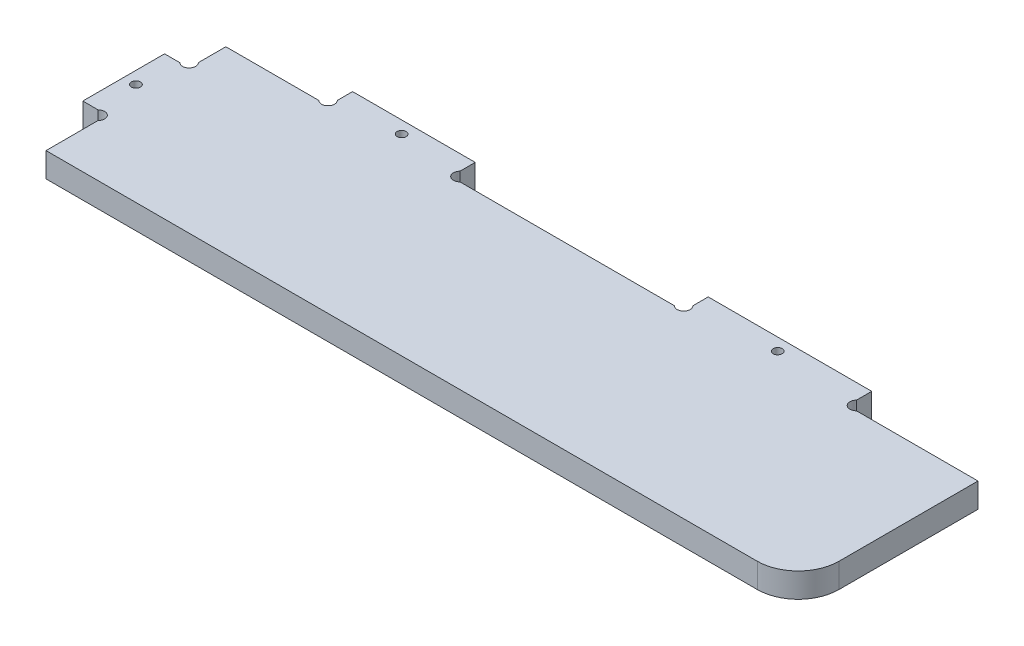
ISO-10303-21;
HEADER;
FILE_DESCRIPTION(('STEP AP214'),'2;1');
FILE_NAME('part.step','',(''),(''),'','','');
FILE_SCHEMA(('AUTOMOTIVE_DESIGN { 1 0 10303 214 1 1 1 1 }'));
ENDSEC;
DATA;
#1=APPLICATION_CONTEXT('core data for automotive mechanical design processes');
#2=APPLICATION_PROTOCOL_DEFINITION('international standard','automotive_design',2000,#1);
#3=PRODUCT_CONTEXT('',#1,'mechanical');
#4=PRODUCT('Part','Part','',(#3));
#5=PRODUCT_RELATED_PRODUCT_CATEGORY('part','',(#4));
#6=PRODUCT_DEFINITION_FORMATION('','',#4);
#7=PRODUCT_DEFINITION_CONTEXT('part definition',#1,'design');
#8=PRODUCT_DEFINITION('design','',#6,#7);
#9=PRODUCT_DEFINITION_SHAPE('','',#8);
#10=(LENGTH_UNIT() NAMED_UNIT(*) SI_UNIT(.MILLI.,.METRE.));
#11=(NAMED_UNIT(*) PLANE_ANGLE_UNIT() SI_UNIT($,.RADIAN.));
#12=(NAMED_UNIT(*) SI_UNIT($,.STERADIAN.) SOLID_ANGLE_UNIT());
#13=UNCERTAINTY_MEASURE_WITH_UNIT(LENGTH_MEASURE(1.E-05),#10,'distance_accuracy_value','');
#14=(GEOMETRIC_REPRESENTATION_CONTEXT(3) GLOBAL_UNCERTAINTY_ASSIGNED_CONTEXT((#13)) GLOBAL_UNIT_ASSIGNED_CONTEXT((#10,
#11,#12)) REPRESENTATION_CONTEXT('',''));
#15=CARTESIAN_POINT('',(0.,0.,0.));
#16=DIRECTION('',(0.,0.,1.));
#17=DIRECTION('',(1.,0.,0.));
#18=AXIS2_PLACEMENT_3D('',#15,#16,#17);
#19=CARTESIAN_POINT('',(29.8686291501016,6.,-45.1313708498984));
#20=DIRECTION('',(0.,1.,0.));
#21=DIRECTION('',(0.,0.,1.));
#22=AXIS2_PLACEMENT_3D('',#19,#20,#21);
#23=PLANE('',#22);
#24=CARTESIAN_POINT('',(46.,6.,-47.));
#25=DIRECTION('',(0.,1.,0.));
#26=DIRECTION('',(0.,0.,1.));
#27=AXIS2_PLACEMENT_3D('',#24,#25,#26);
#28=CIRCLE('',#27,1.1);
#29=CARTESIAN_POINT('',(46.,6.,-45.9));
#30=VERTEX_POINT('',#29);
#31=EDGE_CURVE('E429',#30,#30,#28,.T.);
#32=ORIENTED_EDGE('',*,*,#31,.F.);
#33=EDGE_LOOP('',(#32));
#34=FACE_BOUND('',#33,.T.);
#35=CARTESIAN_POINT('',(29.8686291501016,6.,-45.1313708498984));
#36=DIRECTION('',(0.,-1.,0.));
#37=DIRECTION('',(0.,0.,1.));
#38=AXIS2_PLACEMENT_3D('',#35,#36,#37);
#39=CIRCLE('',#38,1.59999999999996);
#40=CARTESIAN_POINT('',(31.,6.,-46.2627416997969));
#41=VERTEX_POINT('',#40);
#42=CARTESIAN_POINT('',(28.7372583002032,6.,-44.));
#43=VERTEX_POINT('',#42);
#44=EDGE_CURVE('E265',#41,#43,#39,.T.);
#45=ORIENTED_EDGE('',*,*,#44,.T.);
#46=DIRECTION('',(-1.,0.,0.));
#47=VECTOR('',#46,1.);
#48=CARTESIAN_POINT('',(6.00000000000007,6.,-44.));
#49=LINE('',#48,#47);
#50=CARTESIAN_POINT('',(6.00000000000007,6.,-44.));
#51=VERTEX_POINT('',#50);
#52=EDGE_CURVE('E138',#43,#51,#49,.T.);
#53=ORIENTED_EDGE('',*,*,#52,.T.);
#54=DIRECTION('',(0.,0.,1.));
#55=VECTOR('',#54,1.);
#56=CARTESIAN_POINT('',(6.00000000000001,6.,-37.2627416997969));
#57=LINE('',#56,#55);
#58=CARTESIAN_POINT('',(6.00000000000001,6.,-37.2627416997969));
#59=VERTEX_POINT('',#58);
#60=EDGE_CURVE('E325',#51,#59,#57,.T.);
#61=ORIENTED_EDGE('',*,*,#60,.T.);
#62=CARTESIAN_POINT('',(4.86862915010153,6.,-36.1313708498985));
#63=DIRECTION('',(0.,-1.,0.));
#64=DIRECTION('',(0.,0.,1.));
#65=AXIS2_PLACEMENT_3D('',#62,#63,#64);
#66=CIRCLE('',#65,1.59999999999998);
#67=CARTESIAN_POINT('',(3.73725830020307,6.,-35.));
#68=VERTEX_POINT('',#67);
#69=EDGE_CURVE('E344',#59,#68,#66,.T.);
#70=ORIENTED_EDGE('',*,*,#69,.T.);
#71=DIRECTION('',(-1.,0.,0.));
#72=VECTOR('',#71,1.);
#73=CARTESIAN_POINT('',(3.73725830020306,6.,-35.));
#74=LINE('',#73,#72);
#75=CARTESIAN_POINT('',(0.,6.,-35.));
#76=VERTEX_POINT('',#75);
#77=EDGE_CURVE('E341',#68,#76,#74,.T.);
#78=ORIENTED_EDGE('',*,*,#77,.T.);
#79=DIRECTION('',(0.,0.,1.));
#80=VECTOR('',#79,1.);
#81=CARTESIAN_POINT('',(0.,6.,-35.));
#82=LINE('',#81,#80);
#83=CARTESIAN_POINT('',(0.,6.,-15.));
#84=VERTEX_POINT('',#83);
#85=EDGE_CURVE('E343',#76,#84,#82,.T.);
#86=ORIENTED_EDGE('',*,*,#85,.T.);
#87=DIRECTION('',(1.,0.,0.));
#88=VECTOR('',#87,1.);
#89=CARTESIAN_POINT('',(3.73725830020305,6.,-15.));
#90=LINE('',#89,#88);
#91=CARTESIAN_POINT('',(3.73725830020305,6.,-15.));
#92=VERTEX_POINT('',#91);
#93=EDGE_CURVE('E346',#84,#92,#90,.T.);
#94=ORIENTED_EDGE('',*,*,#93,.T.);
#95=CARTESIAN_POINT('',(4.86862915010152,6.,-13.8686291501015));
#96=DIRECTION('',(0.,-1.,0.));
#97=DIRECTION('',(0.,0.,-1.));
#98=AXIS2_PLACEMENT_3D('',#95,#96,#97);
#99=CIRCLE('',#98,1.59999999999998);
#100=CARTESIAN_POINT('',(6.00000000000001,6.,-12.7372583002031));
#101=VERTEX_POINT('',#100);
#102=EDGE_CURVE('E352',#92,#101,#99,.T.);
#103=ORIENTED_EDGE('',*,*,#102,.T.);
#104=DIRECTION('',(0.,0.,1.));
#105=VECTOR('',#104,1.);
#106=CARTESIAN_POINT('',(6.00000000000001,6.,-12.7372583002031));
#107=LINE('',#106,#105);
#108=CARTESIAN_POINT('',(6.00000000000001,6.,0.));
#109=VERTEX_POINT('',#108);
#110=EDGE_CURVE('E354',#101,#109,#107,.T.);
#111=ORIENTED_EDGE('',*,*,#110,.T.);
#112=DIRECTION('',(1.,0.,0.));
#113=VECTOR('',#112,1.);
#114=CARTESIAN_POINT('',(6.00000000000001,6.,0.));
#115=LINE('',#114,#113);
#116=CARTESIAN_POINT('',(180.,6.,0.));
#117=VERTEX_POINT('',#116);
#118=EDGE_CURVE('E356',#109,#117,#115,.T.);
#119=ORIENTED_EDGE('',*,*,#118,.T.);
#120=CARTESIAN_POINT('',(180.,6.,-10.));
#121=DIRECTION('',(0.,1.,0.));
#122=DIRECTION('',(0.,0.,1.));
#123=AXIS2_PLACEMENT_3D('',#120,#121,#122);
#124=CIRCLE('',#123,10.);
#125=CARTESIAN_POINT('',(190.,6.,-10.0000000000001));
#126=VERTEX_POINT('',#125);
#127=EDGE_CURVE('E358',#117,#126,#124,.T.);
#128=ORIENTED_EDGE('',*,*,#127,.T.);
#129=DIRECTION('',(0.,0.,-1.));
#130=VECTOR('',#129,1.);
#131=CARTESIAN_POINT('',(190.,6.,-10.0000000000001));
#132=LINE('',#131,#130);
#133=CARTESIAN_POINT('',(190.,6.,-44.));
#134=VERTEX_POINT('',#133);
#135=EDGE_CURVE('E360',#126,#134,#132,.T.);
#136=ORIENTED_EDGE('',*,*,#135,.T.);
#137=DIRECTION('',(-1.,0.,0.));
#138=VECTOR('',#137,1.);
#139=CARTESIAN_POINT('',(160.262741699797,6.,-44.));
#140=LINE('',#139,#138);
#141=CARTESIAN_POINT('',(160.262741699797,6.,-44.));
#142=VERTEX_POINT('',#141);
#143=EDGE_CURVE('E362',#134,#142,#140,.T.);
#144=ORIENTED_EDGE('',*,*,#143,.T.);
#145=CARTESIAN_POINT('',(159.131370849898,6.,-45.1313708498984));
#146=DIRECTION('',(0.,-1.,0.));
#147=DIRECTION('',(0.,0.,-1.));
#148=AXIS2_PLACEMENT_3D('',#145,#146,#147);
#149=CIRCLE('',#148,1.59999999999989);
#150=CARTESIAN_POINT('',(158.,6.,-46.2627416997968));
#151=VERTEX_POINT('',#150);
#152=EDGE_CURVE('E364',#142,#151,#149,.T.);
#153=ORIENTED_EDGE('',*,*,#152,.T.);
#154=DIRECTION('',(0.,0.,-1.));
#155=VECTOR('',#154,1.);
#156=CARTESIAN_POINT('',(158.,6.,-50.));
#157=LINE('',#156,#155);
#158=CARTESIAN_POINT('',(158.,6.,-50.));
#159=VERTEX_POINT('',#158);
#160=EDGE_CURVE('E366',#151,#159,#157,.T.);
#161=ORIENTED_EDGE('',*,*,#160,.T.);
#162=DIRECTION('',(-1.,0.,0.));
#163=VECTOR('',#162,1.);
#164=CARTESIAN_POINT('',(118.,6.,-50.));
#165=LINE('',#164,#163);
#166=CARTESIAN_POINT('',(118.,6.,-50.));
#167=VERTEX_POINT('',#166);
#168=EDGE_CURVE('E368',#159,#167,#165,.T.);
#169=ORIENTED_EDGE('',*,*,#168,.T.);
#170=DIRECTION('',(0.,0.,1.));
#171=VECTOR('',#170,1.);
#172=CARTESIAN_POINT('',(118.,6.,-46.2627416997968));
#173=LINE('',#172,#171);
#174=CARTESIAN_POINT('',(118.,6.,-46.2627416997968));
#175=VERTEX_POINT('',#174);
#176=EDGE_CURVE('E370',#167,#175,#173,.T.);
#177=ORIENTED_EDGE('',*,*,#176,.T.);
#178=CARTESIAN_POINT('',(116.868629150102,6.,-45.1313708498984));
#179=DIRECTION('',(0.,-1.,0.));
#180=DIRECTION('',(0.,0.,1.));
#181=AXIS2_PLACEMENT_3D('',#178,#179,#180);
#182=CIRCLE('',#181,1.59999999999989);
#183=CARTESIAN_POINT('',(115.737258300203,6.,-44.));
#184=VERTEX_POINT('',#183);
#185=EDGE_CURVE('E372',#175,#184,#182,.T.);
#186=ORIENTED_EDGE('',*,*,#185,.T.);
#187=DIRECTION('',(-1.,0.,0.));
#188=VECTOR('',#187,1.);
#189=CARTESIAN_POINT('',(63.2627416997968,6.,-44.));
#190=LINE('',#189,#188);
#191=CARTESIAN_POINT('',(63.2627416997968,6.,-44.));
#192=VERTEX_POINT('',#191);
#193=EDGE_CURVE('E374',#184,#192,#190,.T.);
#194=ORIENTED_EDGE('',*,*,#193,.T.);
#195=CARTESIAN_POINT('',(62.1313708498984,6.,-45.1313708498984));
#196=DIRECTION('',(0.,-1.,0.));
#197=DIRECTION('',(0.,0.,-1.));
#198=AXIS2_PLACEMENT_3D('',#195,#196,#197);
#199=CIRCLE('',#198,1.59999999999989);
#200=CARTESIAN_POINT('',(61.,6.,-46.2627416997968));
#201=VERTEX_POINT('',#200);
#202=EDGE_CURVE('E202',#192,#201,#199,.T.);
#203=ORIENTED_EDGE('',*,*,#202,.T.);
#204=DIRECTION('',(0.,0.,-1.));
#205=VECTOR('',#204,1.);
#206=CARTESIAN_POINT('',(61.,6.,-50.));
#207=LINE('',#206,#205);
#208=CARTESIAN_POINT('',(61.,6.,-50.));
#209=VERTEX_POINT('',#208);
#210=EDGE_CURVE('E196',#201,#209,#207,.T.);
#211=ORIENTED_EDGE('',*,*,#210,.T.);
#212=DIRECTION('',(-1.,0.,0.));
#213=VECTOR('',#212,1.);
#214=CARTESIAN_POINT('',(31.,6.,-50.));
#215=LINE('',#214,#213);
#216=CARTESIAN_POINT('',(31.,6.,-50.));
#217=VERTEX_POINT('',#216);
#218=EDGE_CURVE('E200',#209,#217,#215,.T.);
#219=ORIENTED_EDGE('',*,*,#218,.T.);
#220=DIRECTION('',(0.,0.,1.));
#221=VECTOR('',#220,1.);
#222=CARTESIAN_POINT('',(31.,6.,-46.2627416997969));
#223=LINE('',#222,#221);
#224=EDGE_CURVE('E50',#217,#41,#223,.T.);
#225=ORIENTED_EDGE('',*,*,#224,.T.);
#226=EDGE_LOOP('',(#45,#53,#61,#70,#78,#86,#94,#103,#111,#119,#128,#136,#144,#153,#161,#169,
#177,#186,#194,#203,#211,#219,#225));
#227=FACE_BOUND('',#226,.T.);
#228=CARTESIAN_POINT('',(3.,6.,-25.));
#229=DIRECTION('',(0.,1.,0.));
#230=DIRECTION('',(0.,0.,1.));
#231=AXIS2_PLACEMENT_3D('',#228,#229,#230);
#232=CIRCLE('',#231,1.1);
#233=CARTESIAN_POINT('',(3.,6.,-23.9));
#234=VERTEX_POINT('',#233);
#235=EDGE_CURVE('E224',#234,#234,#232,.T.);
#236=ORIENTED_EDGE('',*,*,#235,.F.);
#237=EDGE_LOOP('',(#236));
#238=FACE_BOUND('',#237,.T.);
#239=CARTESIAN_POINT('',(138.,6.,-47.));
#240=DIRECTION('',(0.,1.,0.));
#241=DIRECTION('',(0.,0.,1.));
#242=AXIS2_PLACEMENT_3D('',#239,#240,#241);
#243=CIRCLE('',#242,1.09999999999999);
#244=CARTESIAN_POINT('',(138.,6.,-45.9));
#245=VERTEX_POINT('',#244);
#246=EDGE_CURVE('E420',#245,#245,#243,.T.);
#247=ORIENTED_EDGE('',*,*,#246,.F.);
#248=EDGE_LOOP('',(#247));
#249=FACE_BOUND('',#248,.T.);
#250=ADVANCED_FACE('F33',(#34,#227,#238,#249),#23,.T.);
#251=CARTESIAN_POINT('',(29.8686291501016,0.,-45.1313708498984));
#252=DIRECTION('',(0.,1.,0.));
#253=DIRECTION('',(0.,0.,1.));
#254=AXIS2_PLACEMENT_3D('',#251,#252,#253);
#255=PLANE('',#254);
#256=CARTESIAN_POINT('',(29.8686291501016,0.,-45.1313708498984));
#257=DIRECTION('',(0.,-1.,0.));
#258=DIRECTION('',(0.,0.,1.));
#259=AXIS2_PLACEMENT_3D('',#256,#257,#258);
#260=CIRCLE('',#259,1.59999999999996);
#261=CARTESIAN_POINT('',(31.,0.,-46.2627416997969));
#262=VERTEX_POINT('',#261);
#263=CARTESIAN_POINT('',(28.7372583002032,0.,-44.));
#264=VERTEX_POINT('',#263);
#265=EDGE_CURVE('E220',#262,#264,#260,.T.);
#266=ORIENTED_EDGE('',*,*,#265,.F.);
#267=DIRECTION('',(0.,0.,1.));
#268=VECTOR('',#267,1.);
#269=CARTESIAN_POINT('',(31.,0.,-46.2627416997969));
#270=LINE('',#269,#268);
#271=CARTESIAN_POINT('',(31.,0.,-50.));
#272=VERTEX_POINT('',#271);
#273=EDGE_CURVE('E130',#272,#262,#270,.T.);
#274=ORIENTED_EDGE('',*,*,#273,.F.);
#275=DIRECTION('',(-1.,0.,0.));
#276=VECTOR('',#275,1.);
#277=CARTESIAN_POINT('',(31.,0.,-50.));
#278=LINE('',#277,#276);
#279=CARTESIAN_POINT('',(61.,0.,-50.));
#280=VERTEX_POINT('',#279);
#281=EDGE_CURVE('E124',#280,#272,#278,.T.);
#282=ORIENTED_EDGE('',*,*,#281,.F.);
#283=DIRECTION('',(0.,0.,-1.));
#284=VECTOR('',#283,1.);
#285=CARTESIAN_POINT('',(61.,0.,-50.));
#286=LINE('',#285,#284);
#287=CARTESIAN_POINT('',(61.,0.,-46.2627416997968));
#288=VERTEX_POINT('',#287);
#289=EDGE_CURVE('E210',#288,#280,#286,.T.);
#290=ORIENTED_EDGE('',*,*,#289,.F.);
#291=CARTESIAN_POINT('',(62.1313708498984,0.,-45.1313708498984));
#292=DIRECTION('',(0.,-1.,0.));
#293=DIRECTION('',(0.,0.,-1.));
#294=AXIS2_PLACEMENT_3D('',#291,#292,#293);
#295=CIRCLE('',#294,1.59999999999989);
#296=CARTESIAN_POINT('',(63.2627416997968,0.,-44.));
#297=VERTEX_POINT('',#296);
#298=EDGE_CURVE('E260',#297,#288,#295,.T.);
#299=ORIENTED_EDGE('',*,*,#298,.F.);
#300=DIRECTION('',(-1.,0.,0.));
#301=VECTOR('',#300,1.);
#302=CARTESIAN_POINT('',(63.2627416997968,0.,-44.));
#303=LINE('',#302,#301);
#304=CARTESIAN_POINT('',(115.737258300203,0.,-44.));
#305=VERTEX_POINT('',#304);
#306=EDGE_CURVE('E258',#305,#297,#303,.T.);
#307=ORIENTED_EDGE('',*,*,#306,.F.);
#308=CARTESIAN_POINT('',(116.868629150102,0.,-45.1313708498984));
#309=DIRECTION('',(0.,-1.,0.));
#310=DIRECTION('',(0.,0.,1.));
#311=AXIS2_PLACEMENT_3D('',#308,#309,#310);
#312=CIRCLE('',#311,1.59999999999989);
#313=CARTESIAN_POINT('',(118.,0.,-46.2627416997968));
#314=VERTEX_POINT('',#313);
#315=EDGE_CURVE('E256',#314,#305,#312,.T.);
#316=ORIENTED_EDGE('',*,*,#315,.F.);
#317=DIRECTION('',(0.,0.,1.));
#318=VECTOR('',#317,1.);
#319=CARTESIAN_POINT('',(118.,0.,-46.2627416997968));
#320=LINE('',#319,#318);
#321=CARTESIAN_POINT('',(118.,0.,-50.));
#322=VERTEX_POINT('',#321);
#323=EDGE_CURVE('E254',#322,#314,#320,.T.);
#324=ORIENTED_EDGE('',*,*,#323,.F.);
#325=DIRECTION('',(-1.,0.,0.));
#326=VECTOR('',#325,1.);
#327=CARTESIAN_POINT('',(118.,0.,-50.));
#328=LINE('',#327,#326);
#329=CARTESIAN_POINT('',(158.,0.,-50.));
#330=VERTEX_POINT('',#329);
#331=EDGE_CURVE('E252',#330,#322,#328,.T.);
#332=ORIENTED_EDGE('',*,*,#331,.F.);
#333=DIRECTION('',(0.,0.,-1.));
#334=VECTOR('',#333,1.);
#335=CARTESIAN_POINT('',(158.,0.,-50.));
#336=LINE('',#335,#334);
#337=CARTESIAN_POINT('',(158.,0.,-46.2627416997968));
#338=VERTEX_POINT('',#337);
#339=EDGE_CURVE('E250',#338,#330,#336,.T.);
#340=ORIENTED_EDGE('',*,*,#339,.F.);
#341=CARTESIAN_POINT('',(159.131370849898,0.,-45.1313708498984));
#342=DIRECTION('',(0.,-1.,0.));
#343=DIRECTION('',(0.,0.,-1.));
#344=AXIS2_PLACEMENT_3D('',#341,#342,#343);
#345=CIRCLE('',#344,1.59999999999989);
#346=CARTESIAN_POINT('',(160.262741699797,0.,-44.));
#347=VERTEX_POINT('',#346);
#348=EDGE_CURVE('E248',#347,#338,#345,.T.);
#349=ORIENTED_EDGE('',*,*,#348,.F.);
#350=DIRECTION('',(-1.,0.,0.));
#351=VECTOR('',#350,1.);
#352=CARTESIAN_POINT('',(160.262741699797,0.,-44.));
#353=LINE('',#352,#351);
#354=CARTESIAN_POINT('',(190.,0.,-44.));
#355=VERTEX_POINT('',#354);
#356=EDGE_CURVE('E246',#355,#347,#353,.T.);
#357=ORIENTED_EDGE('',*,*,#356,.F.);
#358=DIRECTION('',(0.,0.,-1.));
#359=VECTOR('',#358,1.);
#360=CARTESIAN_POINT('',(190.,0.,-10.0000000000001));
#361=LINE('',#360,#359);
#362=CARTESIAN_POINT('',(190.,0.,-10.0000000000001));
#363=VERTEX_POINT('',#362);
#364=EDGE_CURVE('E244',#363,#355,#361,.T.);
#365=ORIENTED_EDGE('',*,*,#364,.F.);
#366=CARTESIAN_POINT('',(180.,0.,-10.));
#367=DIRECTION('',(0.,1.,0.));
#368=DIRECTION('',(0.,0.,1.));
#369=AXIS2_PLACEMENT_3D('',#366,#367,#368);
#370=CIRCLE('',#369,10.);
#371=CARTESIAN_POINT('',(180.,0.,0.));
#372=VERTEX_POINT('',#371);
#373=EDGE_CURVE('E242',#372,#363,#370,.T.);
#374=ORIENTED_EDGE('',*,*,#373,.F.);
#375=DIRECTION('',(1.,0.,0.));
#376=VECTOR('',#375,1.);
#377=CARTESIAN_POINT('',(6.00000000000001,0.,0.));
#378=LINE('',#377,#376);
#379=CARTESIAN_POINT('',(6.00000000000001,0.,0.));
#380=VERTEX_POINT('',#379);
#381=EDGE_CURVE('E240',#380,#372,#378,.T.);
#382=ORIENTED_EDGE('',*,*,#381,.F.);
#383=DIRECTION('',(0.,0.,1.));
#384=VECTOR('',#383,1.);
#385=CARTESIAN_POINT('',(6.00000000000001,0.,-12.7372583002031));
#386=LINE('',#385,#384);
#387=CARTESIAN_POINT('',(6.00000000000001,0.,-12.7372583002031));
#388=VERTEX_POINT('',#387);
#389=EDGE_CURVE('E238',#388,#380,#386,.T.);
#390=ORIENTED_EDGE('',*,*,#389,.F.);
#391=CARTESIAN_POINT('',(4.86862915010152,0.,-13.8686291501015));
#392=DIRECTION('',(0.,-1.,0.));
#393=DIRECTION('',(0.,0.,-1.));
#394=AXIS2_PLACEMENT_3D('',#391,#392,#393);
#395=CIRCLE('',#394,1.59999999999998);
#396=CARTESIAN_POINT('',(3.73725830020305,0.,-15.));
#397=VERTEX_POINT('',#396);
#398=EDGE_CURVE('E236',#397,#388,#395,.T.);
#399=ORIENTED_EDGE('',*,*,#398,.F.);
#400=DIRECTION('',(1.,0.,0.));
#401=VECTOR('',#400,1.);
#402=CARTESIAN_POINT('',(3.73725830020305,0.,-15.));
#403=LINE('',#402,#401);
#404=CARTESIAN_POINT('',(0.,0.,-15.));
#405=VERTEX_POINT('',#404);
#406=EDGE_CURVE('E234',#405,#397,#403,.T.);
#407=ORIENTED_EDGE('',*,*,#406,.F.);
#408=DIRECTION('',(0.,0.,1.));
#409=VECTOR('',#408,1.);
#410=CARTESIAN_POINT('',(0.,0.,-35.));
#411=LINE('',#410,#409);
#412=CARTESIAN_POINT('',(0.,0.,-35.));
#413=VERTEX_POINT('',#412);
#414=EDGE_CURVE('E232',#413,#405,#411,.T.);
#415=ORIENTED_EDGE('',*,*,#414,.F.);
#416=DIRECTION('',(-1.,0.,0.));
#417=VECTOR('',#416,1.);
#418=CARTESIAN_POINT('',(3.73725830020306,0.,-35.));
#419=LINE('',#418,#417);
#420=CARTESIAN_POINT('',(3.73725830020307,0.,-35.));
#421=VERTEX_POINT('',#420);
#422=EDGE_CURVE('E230',#421,#413,#419,.T.);
#423=ORIENTED_EDGE('',*,*,#422,.F.);
#424=CARTESIAN_POINT('',(4.86862915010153,0.,-36.1313708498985));
#425=DIRECTION('',(0.,-1.,0.));
#426=DIRECTION('',(0.,0.,1.));
#427=AXIS2_PLACEMENT_3D('',#424,#425,#426);
#428=CIRCLE('',#427,1.59999999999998);
#429=CARTESIAN_POINT('',(6.00000000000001,0.,-37.2627416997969));
#430=VERTEX_POINT('',#429);
#431=EDGE_CURVE('E228',#430,#421,#428,.T.);
#432=ORIENTED_EDGE('',*,*,#431,.F.);
#433=DIRECTION('',(0.,0.,1.));
#434=VECTOR('',#433,1.);
#435=CARTESIAN_POINT('',(6.00000000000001,0.,-37.2627416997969));
#436=LINE('',#435,#434);
#437=CARTESIAN_POINT('',(6.00000000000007,0.,-44.));
#438=VERTEX_POINT('',#437);
#439=EDGE_CURVE('E226',#438,#430,#436,.T.);
#440=ORIENTED_EDGE('',*,*,#439,.F.);
#441=DIRECTION('',(-1.,0.,0.));
#442=VECTOR('',#441,1.);
#443=CARTESIAN_POINT('',(6.00000000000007,0.,-44.));
#444=LINE('',#443,#442);
#445=EDGE_CURVE('E223',#264,#438,#444,.T.);
#446=ORIENTED_EDGE('',*,*,#445,.F.);
#447=EDGE_LOOP('',(#266,#274,#282,#290,#299,#307,#316,#324,#332,#340,#349,#357,#365,#374,#382,
#390,#399,#407,#415,#423,#432,#440,#446));
#448=FACE_BOUND('',#447,.T.);
#449=CARTESIAN_POINT('',(3.,0.,-25.));
#450=DIRECTION('',(0.,1.,0.));
#451=DIRECTION('',(0.,0.,1.));
#452=AXIS2_PLACEMENT_3D('',#449,#450,#451);
#453=CIRCLE('',#452,1.1);
#454=CARTESIAN_POINT('',(3.,0.,-23.9));
#455=VERTEX_POINT('',#454);
#456=EDGE_CURVE('E432',#455,#455,#453,.T.);
#457=ORIENTED_EDGE('',*,*,#456,.T.);
#458=EDGE_LOOP('',(#457));
#459=FACE_BOUND('',#458,.T.);
#460=CARTESIAN_POINT('',(46.,0.,-47.));
#461=DIRECTION('',(0.,1.,0.));
#462=DIRECTION('',(0.,0.,1.));
#463=AXIS2_PLACEMENT_3D('',#460,#461,#462);
#464=CIRCLE('',#463,1.1);
#465=CARTESIAN_POINT('',(46.,0.,-45.9));
#466=VERTEX_POINT('',#465);
#467=EDGE_CURVE('E426',#466,#466,#464,.T.);
#468=ORIENTED_EDGE('',*,*,#467,.T.);
#469=EDGE_LOOP('',(#468));
#470=FACE_BOUND('',#469,.T.);
#471=CARTESIAN_POINT('',(138.,0.,-47.));
#472=DIRECTION('',(0.,1.,0.));
#473=DIRECTION('',(0.,0.,1.));
#474=AXIS2_PLACEMENT_3D('',#471,#472,#473);
#475=CIRCLE('',#474,1.09999999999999);
#476=CARTESIAN_POINT('',(138.,0.,-45.9));
#477=VERTEX_POINT('',#476);
#478=EDGE_CURVE('E423',#477,#477,#475,.T.);
#479=ORIENTED_EDGE('',*,*,#478,.T.);
#480=EDGE_LOOP('',(#479));
#481=FACE_BOUND('',#480,.T.);
#482=ADVANCED_FACE('F329',(#448,#459,#470,#481),#255,.F.);
#483=CARTESIAN_POINT('',(29.8686291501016,6.,-45.1313708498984));
#484=DIRECTION('',(0.,-1.,0.));
#485=DIRECTION('',(0.,0.,-1.));
#486=AXIS2_PLACEMENT_3D('',#483,#484,#485);
#487=CYLINDRICAL_SURFACE('',#486,1.59999999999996);
#488=ORIENTED_EDGE('',*,*,#265,.T.);
#489=DIRECTION('',(0.,-1.,0.));
#490=VECTOR('',#489,1.);
#491=CARTESIAN_POINT('',(28.7372583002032,6.,-44.));
#492=LINE('',#491,#490);
#493=EDGE_CURVE('E11',#43,#264,#492,.T.);
#494=ORIENTED_EDGE('',*,*,#493,.F.);
#495=ORIENTED_EDGE('',*,*,#44,.F.);
#496=DIRECTION('',(0.,-1.,0.));
#497=VECTOR('',#496,1.);
#498=CARTESIAN_POINT('',(31.,6.,-46.2627416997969));
#499=LINE('',#498,#497);
#500=EDGE_CURVE('E216',#41,#262,#499,.T.);
#501=ORIENTED_EDGE('',*,*,#500,.T.);
#502=EDGE_LOOP('',(#488,#494,#495,#501));
#503=FACE_BOUND('',#502,.T.);
#504=ADVANCED_FACE('F35',(#503),#487,.F.);
#505=CARTESIAN_POINT('',(6.00000000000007,6.,-44.));
#506=DIRECTION('',(0.,0.,1.));
#507=DIRECTION('',(1.,0.,0.));
#508=AXIS2_PLACEMENT_3D('',#505,#506,#507);
#509=PLANE('',#508);
#510=ORIENTED_EDGE('',*,*,#445,.T.);
#511=DIRECTION('',(0.,-1.,0.));
#512=VECTOR('',#511,1.);
#513=CARTESIAN_POINT('',(6.00000000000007,6.,-44.));
#514=LINE('',#513,#512);
#515=EDGE_CURVE('E42',#51,#438,#514,.T.);
#516=ORIENTED_EDGE('',*,*,#515,.F.);
#517=ORIENTED_EDGE('',*,*,#52,.F.);
#518=ORIENTED_EDGE('',*,*,#493,.T.);
#519=EDGE_LOOP('',(#510,#516,#517,#518));
#520=FACE_BOUND('',#519,.T.);
#521=ADVANCED_FACE('F644',(#520),#509,.F.);
#522=CARTESIAN_POINT('',(6.00000000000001,6.,-37.2627416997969));
#523=DIRECTION('',(1.,0.,0.));
#524=DIRECTION('',(0.,0.,-1.));
#525=AXIS2_PLACEMENT_3D('',#522,#523,#524);
#526=PLANE('',#525);
#527=ORIENTED_EDGE('',*,*,#439,.T.);
#528=DIRECTION('',(0.,-1.,0.));
#529=VECTOR('',#528,1.);
#530=CARTESIAN_POINT('',(6.00000000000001,6.,-37.2627416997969));
#531=LINE('',#530,#529);
#532=EDGE_CURVE('E317',#59,#430,#531,.T.);
#533=ORIENTED_EDGE('',*,*,#532,.F.);
#534=ORIENTED_EDGE('',*,*,#60,.F.);
#535=ORIENTED_EDGE('',*,*,#515,.T.);
#536=EDGE_LOOP('',(#527,#533,#534,#535));
#537=FACE_BOUND('',#536,.T.);
#538=ADVANCED_FACE('F323',(#537),#526,.F.);
#539=CARTESIAN_POINT('',(4.86862915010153,6.,-36.1313708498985));
#540=DIRECTION('',(0.,-1.,0.));
#541=DIRECTION('',(0.,0.,-1.));
#542=AXIS2_PLACEMENT_3D('',#539,#540,#541);
#543=CYLINDRICAL_SURFACE('',#542,1.59999999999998);
#544=ORIENTED_EDGE('',*,*,#431,.T.);
#545=DIRECTION('',(0.,-1.,0.));
#546=VECTOR('',#545,1.);
#547=CARTESIAN_POINT('',(3.73725830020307,6.,-35.));
#548=LINE('',#547,#546);
#549=EDGE_CURVE('E314',#68,#421,#548,.T.);
#550=ORIENTED_EDGE('',*,*,#549,.F.);
#551=ORIENTED_EDGE('',*,*,#69,.F.);
#552=ORIENTED_EDGE('',*,*,#532,.T.);
#553=EDGE_LOOP('',(#544,#550,#551,#552));
#554=FACE_BOUND('',#553,.T.);
#555=ADVANCED_FACE('F335',(#554),#543,.F.);
#556=CARTESIAN_POINT('',(3.73725830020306,6.,-35.));
#557=DIRECTION('',(0.,0.,1.));
#558=DIRECTION('',(1.,0.,0.));
#559=AXIS2_PLACEMENT_3D('',#556,#557,#558);
#560=PLANE('',#559);
#561=ORIENTED_EDGE('',*,*,#422,.T.);
#562=DIRECTION('',(0.,-1.,0.));
#563=VECTOR('',#562,1.);
#564=CARTESIAN_POINT('',(0.,6.,-35.));
#565=LINE('',#564,#563);
#566=EDGE_CURVE('E311',#76,#413,#565,.T.);
#567=ORIENTED_EDGE('',*,*,#566,.F.);
#568=ORIENTED_EDGE('',*,*,#77,.F.);
#569=ORIENTED_EDGE('',*,*,#549,.T.);
#570=EDGE_LOOP('',(#561,#567,#568,#569));
#571=FACE_BOUND('',#570,.T.);
#572=ADVANCED_FACE('F339',(#571),#560,.F.);
#573=CARTESIAN_POINT('',(0.,6.,-35.));
#574=DIRECTION('',(1.,0.,0.));
#575=DIRECTION('',(0.,0.,-1.));
#576=AXIS2_PLACEMENT_3D('',#573,#574,#575);
#577=PLANE('',#576);
#578=ORIENTED_EDGE('',*,*,#414,.T.);
#579=DIRECTION('',(0.,-1.,0.));
#580=VECTOR('',#579,1.);
#581=CARTESIAN_POINT('',(0.,6.,-15.));
#582=LINE('',#581,#580);
#583=EDGE_CURVE('E308',#84,#405,#582,.T.);
#584=ORIENTED_EDGE('',*,*,#583,.F.);
#585=ORIENTED_EDGE('',*,*,#85,.F.);
#586=ORIENTED_EDGE('',*,*,#566,.T.);
#587=EDGE_LOOP('',(#578,#584,#585,#586));
#588=FACE_BOUND('',#587,.T.);
#589=ADVANCED_FACE('F609',(#588),#577,.F.);
#590=CARTESIAN_POINT('',(3.73725830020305,6.,-15.));
#591=DIRECTION('',(0.,0.,-1.));
#592=DIRECTION('',(-1.,0.,0.));
#593=AXIS2_PLACEMENT_3D('',#590,#591,#592);
#594=PLANE('',#593);
#595=ORIENTED_EDGE('',*,*,#406,.T.);
#596=DIRECTION('',(0.,-1.,0.));
#597=VECTOR('',#596,1.);
#598=CARTESIAN_POINT('',(3.73725830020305,6.,-15.));
#599=LINE('',#598,#597);
#600=EDGE_CURVE('E305',#92,#397,#599,.T.);
#601=ORIENTED_EDGE('',*,*,#600,.F.);
#602=ORIENTED_EDGE('',*,*,#93,.F.);
#603=ORIENTED_EDGE('',*,*,#583,.T.);
#604=EDGE_LOOP('',(#595,#601,#602,#603));
#605=FACE_BOUND('',#604,.T.);
#606=ADVANCED_FACE('F599',(#605),#594,.F.);
#607=CARTESIAN_POINT('',(4.86862915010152,6.,-13.8686291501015));
#608=DIRECTION('',(0.,-1.,0.));
#609=DIRECTION('',(0.,0.,-1.));
#610=AXIS2_PLACEMENT_3D('',#607,#608,#609);
#611=CYLINDRICAL_SURFACE('',#610,1.59999999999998);
#612=ORIENTED_EDGE('',*,*,#398,.T.);
#613=DIRECTION('',(0.,-1.,0.));
#614=VECTOR('',#613,1.);
#615=CARTESIAN_POINT('',(6.00000000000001,6.,-12.7372583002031));
#616=LINE('',#615,#614);
#617=EDGE_CURVE('E302',#101,#388,#616,.T.);
#618=ORIENTED_EDGE('',*,*,#617,.F.);
#619=ORIENTED_EDGE('',*,*,#102,.F.);
#620=ORIENTED_EDGE('',*,*,#600,.T.);
#621=EDGE_LOOP('',(#612,#618,#619,#620));
#622=FACE_BOUND('',#621,.T.);
#623=ADVANCED_FACE('F589',(#622),#611,.F.);
#624=CARTESIAN_POINT('',(6.00000000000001,6.,-12.7372583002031));
#625=DIRECTION('',(1.,0.,0.));
#626=DIRECTION('',(0.,0.,-1.));
#627=AXIS2_PLACEMENT_3D('',#624,#625,#626);
#628=PLANE('',#627);
#629=ORIENTED_EDGE('',*,*,#389,.T.);
#630=DIRECTION('',(0.,-1.,0.));
#631=VECTOR('',#630,1.);
#632=CARTESIAN_POINT('',(6.00000000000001,6.,0.));
#633=LINE('',#632,#631);
#634=EDGE_CURVE('E299',#109,#380,#633,.T.);
#635=ORIENTED_EDGE('',*,*,#634,.F.);
#636=ORIENTED_EDGE('',*,*,#110,.F.);
#637=ORIENTED_EDGE('',*,*,#617,.T.);
#638=EDGE_LOOP('',(#629,#635,#636,#637));
#639=FACE_BOUND('',#638,.T.);
#640=ADVANCED_FACE('F579',(#639),#628,.F.);
#641=CARTESIAN_POINT('',(6.00000000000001,6.,0.));
#642=DIRECTION('',(0.,0.,-1.));
#643=DIRECTION('',(-1.,0.,0.));
#644=AXIS2_PLACEMENT_3D('',#641,#642,#643);
#645=PLANE('',#644);
#646=ORIENTED_EDGE('',*,*,#381,.T.);
#647=DIRECTION('',(0.,-1.,0.));
#648=VECTOR('',#647,1.);
#649=CARTESIAN_POINT('',(180.,6.,0.));
#650=LINE('',#649,#648);
#651=EDGE_CURVE('E296',#117,#372,#650,.T.);
#652=ORIENTED_EDGE('',*,*,#651,.F.);
#653=ORIENTED_EDGE('',*,*,#118,.F.);
#654=ORIENTED_EDGE('',*,*,#634,.T.);
#655=EDGE_LOOP('',(#646,#652,#653,#654));
#656=FACE_BOUND('',#655,.T.);
#657=ADVANCED_FACE('F569',(#656),#645,.F.);
#658=CARTESIAN_POINT('',(180.,6.,-10.));
#659=DIRECTION('',(0.,-1.,0.));
#660=DIRECTION('',(0.,0.,-1.));
#661=AXIS2_PLACEMENT_3D('',#658,#659,#660);
#662=CYLINDRICAL_SURFACE('',#661,10.);
#663=ORIENTED_EDGE('',*,*,#373,.T.);
#664=DIRECTION('',(0.,-1.,0.));
#665=VECTOR('',#664,1.);
#666=CARTESIAN_POINT('',(190.,6.,-10.0000000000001));
#667=LINE('',#666,#665);
#668=EDGE_CURVE('E293',#126,#363,#667,.T.);
#669=ORIENTED_EDGE('',*,*,#668,.F.);
#670=ORIENTED_EDGE('',*,*,#127,.F.);
#671=ORIENTED_EDGE('',*,*,#651,.T.);
#672=EDGE_LOOP('',(#663,#669,#670,#671));
#673=FACE_BOUND('',#672,.T.);
#674=ADVANCED_FACE('F559',(#673),#662,.T.);
#675=CARTESIAN_POINT('',(190.,6.,-10.0000000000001));
#676=DIRECTION('',(-1.,0.,0.));
#677=DIRECTION('',(0.,0.,1.));
#678=AXIS2_PLACEMENT_3D('',#675,#676,#677);
#679=PLANE('',#678);
#680=ORIENTED_EDGE('',*,*,#364,.T.);
#681=DIRECTION('',(0.,-1.,0.));
#682=VECTOR('',#681,1.);
#683=CARTESIAN_POINT('',(190.,6.,-44.));
#684=LINE('',#683,#682);
#685=EDGE_CURVE('E290',#134,#355,#684,.T.);
#686=ORIENTED_EDGE('',*,*,#685,.F.);
#687=ORIENTED_EDGE('',*,*,#135,.F.);
#688=ORIENTED_EDGE('',*,*,#668,.T.);
#689=EDGE_LOOP('',(#680,#686,#687,#688));
#690=FACE_BOUND('',#689,.T.);
#691=ADVANCED_FACE('F549',(#690),#679,.F.);
#692=CARTESIAN_POINT('',(160.262741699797,6.,-44.));
#693=DIRECTION('',(0.,0.,1.));
#694=DIRECTION('',(1.,0.,0.));
#695=AXIS2_PLACEMENT_3D('',#692,#693,#694);
#696=PLANE('',#695);
#697=ORIENTED_EDGE('',*,*,#356,.T.);
#698=DIRECTION('',(0.,-1.,0.));
#699=VECTOR('',#698,1.);
#700=CARTESIAN_POINT('',(160.262741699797,6.,-44.));
#701=LINE('',#700,#699);
#702=EDGE_CURVE('E287',#142,#347,#701,.T.);
#703=ORIENTED_EDGE('',*,*,#702,.F.);
#704=ORIENTED_EDGE('',*,*,#143,.F.);
#705=ORIENTED_EDGE('',*,*,#685,.T.);
#706=EDGE_LOOP('',(#697,#703,#704,#705));
#707=FACE_BOUND('',#706,.T.);
#708=ADVANCED_FACE('F539',(#707),#696,.F.);
#709=CARTESIAN_POINT('',(159.131370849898,6.,-45.1313708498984));
#710=DIRECTION('',(0.,-1.,0.));
#711=DIRECTION('',(0.,0.,-1.));
#712=AXIS2_PLACEMENT_3D('',#709,#710,#711);
#713=CYLINDRICAL_SURFACE('',#712,1.59999999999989);
#714=ORIENTED_EDGE('',*,*,#348,.T.);
#715=DIRECTION('',(0.,-1.,0.));
#716=VECTOR('',#715,1.);
#717=CARTESIAN_POINT('',(158.,6.,-46.2627416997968));
#718=LINE('',#717,#716);
#719=EDGE_CURVE('E284',#151,#338,#718,.T.);
#720=ORIENTED_EDGE('',*,*,#719,.F.);
#721=ORIENTED_EDGE('',*,*,#152,.F.);
#722=ORIENTED_EDGE('',*,*,#702,.T.);
#723=EDGE_LOOP('',(#714,#720,#721,#722));
#724=FACE_BOUND('',#723,.T.);
#725=ADVANCED_FACE('F529',(#724),#713,.F.);
#726=CARTESIAN_POINT('',(158.,6.,-50.));
#727=DIRECTION('',(-1.,0.,0.));
#728=DIRECTION('',(0.,0.,1.));
#729=AXIS2_PLACEMENT_3D('',#726,#727,#728);
#730=PLANE('',#729);
#731=ORIENTED_EDGE('',*,*,#339,.T.);
#732=DIRECTION('',(0.,-1.,0.));
#733=VECTOR('',#732,1.);
#734=CARTESIAN_POINT('',(158.,6.,-50.));
#735=LINE('',#734,#733);
#736=EDGE_CURVE('E281',#159,#330,#735,.T.);
#737=ORIENTED_EDGE('',*,*,#736,.F.);
#738=ORIENTED_EDGE('',*,*,#160,.F.);
#739=ORIENTED_EDGE('',*,*,#719,.T.);
#740=EDGE_LOOP('',(#731,#737,#738,#739));
#741=FACE_BOUND('',#740,.T.);
#742=ADVANCED_FACE('F519',(#741),#730,.F.);
#743=CARTESIAN_POINT('',(118.,6.,-50.));
#744=DIRECTION('',(0.,0.,1.));
#745=DIRECTION('',(1.,0.,0.));
#746=AXIS2_PLACEMENT_3D('',#743,#744,#745);
#747=PLANE('',#746);
#748=ORIENTED_EDGE('',*,*,#331,.T.);
#749=DIRECTION('',(0.,-1.,0.));
#750=VECTOR('',#749,1.);
#751=CARTESIAN_POINT('',(118.,6.,-50.));
#752=LINE('',#751,#750);
#753=EDGE_CURVE('E278',#167,#322,#752,.T.);
#754=ORIENTED_EDGE('',*,*,#753,.F.);
#755=ORIENTED_EDGE('',*,*,#168,.F.);
#756=ORIENTED_EDGE('',*,*,#736,.T.);
#757=EDGE_LOOP('',(#748,#754,#755,#756));
#758=FACE_BOUND('',#757,.T.);
#759=ADVANCED_FACE('F509',(#758),#747,.F.);
#760=CARTESIAN_POINT('',(118.,6.,-46.2627416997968));
#761=DIRECTION('',(1.,0.,0.));
#762=DIRECTION('',(0.,0.,-1.));
#763=AXIS2_PLACEMENT_3D('',#760,#761,#762);
#764=PLANE('',#763);
#765=ORIENTED_EDGE('',*,*,#323,.T.);
#766=DIRECTION('',(0.,-1.,0.));
#767=VECTOR('',#766,1.);
#768=CARTESIAN_POINT('',(118.,6.,-46.2627416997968));
#769=LINE('',#768,#767);
#770=EDGE_CURVE('E275',#175,#314,#769,.T.);
#771=ORIENTED_EDGE('',*,*,#770,.F.);
#772=ORIENTED_EDGE('',*,*,#176,.F.);
#773=ORIENTED_EDGE('',*,*,#753,.T.);
#774=EDGE_LOOP('',(#765,#771,#772,#773));
#775=FACE_BOUND('',#774,.T.);
#776=ADVANCED_FACE('F499',(#775),#764,.F.);
#777=CARTESIAN_POINT('',(116.868629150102,6.,-45.1313708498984));
#778=DIRECTION('',(0.,-1.,0.));
#779=DIRECTION('',(0.,0.,-1.));
#780=AXIS2_PLACEMENT_3D('',#777,#778,#779);
#781=CYLINDRICAL_SURFACE('',#780,1.59999999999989);
#782=ORIENTED_EDGE('',*,*,#315,.T.);
#783=DIRECTION('',(0.,-1.,0.));
#784=VECTOR('',#783,1.);
#785=CARTESIAN_POINT('',(115.737258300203,6.,-44.));
#786=LINE('',#785,#784);
#787=EDGE_CURVE('E272',#184,#305,#786,.T.);
#788=ORIENTED_EDGE('',*,*,#787,.F.);
#789=ORIENTED_EDGE('',*,*,#185,.F.);
#790=ORIENTED_EDGE('',*,*,#770,.T.);
#791=EDGE_LOOP('',(#782,#788,#789,#790));
#792=FACE_BOUND('',#791,.T.);
#793=ADVANCED_FACE('F490',(#792),#781,.F.);
#794=CARTESIAN_POINT('',(63.2627416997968,6.,-44.));
#795=DIRECTION('',(0.,0.,1.));
#796=DIRECTION('',(1.,0.,0.));
#797=AXIS2_PLACEMENT_3D('',#794,#795,#796);
#798=PLANE('',#797);
#799=ORIENTED_EDGE('',*,*,#306,.T.);
#800=DIRECTION('',(0.,-1.,0.));
#801=VECTOR('',#800,1.);
#802=CARTESIAN_POINT('',(63.2627416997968,6.,-44.));
#803=LINE('',#802,#801);
#804=EDGE_CURVE('E269',#192,#297,#803,.T.);
#805=ORIENTED_EDGE('',*,*,#804,.F.);
#806=ORIENTED_EDGE('',*,*,#193,.F.);
#807=ORIENTED_EDGE('',*,*,#787,.T.);
#808=EDGE_LOOP('',(#799,#805,#806,#807));
#809=FACE_BOUND('',#808,.T.);
#810=ADVANCED_FACE('F380',(#809),#798,.F.);
#811=CARTESIAN_POINT('',(62.1313708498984,6.,-45.1313708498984));
#812=DIRECTION('',(0.,-1.,0.));
#813=DIRECTION('',(0.,0.,-1.));
#814=AXIS2_PLACEMENT_3D('',#811,#812,#813);
#815=CYLINDRICAL_SURFACE('',#814,1.59999999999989);
#816=ORIENTED_EDGE('',*,*,#298,.T.);
#817=DIRECTION('',(0.,-1.,0.));
#818=VECTOR('',#817,1.);
#819=CARTESIAN_POINT('',(61.,6.,-46.2627416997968));
#820=LINE('',#819,#818);
#821=EDGE_CURVE('E211',#201,#288,#820,.T.);
#822=ORIENTED_EDGE('',*,*,#821,.F.);
#823=ORIENTED_EDGE('',*,*,#202,.F.);
#824=ORIENTED_EDGE('',*,*,#804,.T.);
#825=EDGE_LOOP('',(#816,#822,#823,#824));
#826=FACE_BOUND('',#825,.T.);
#827=ADVANCED_FACE('F384',(#826),#815,.F.);
#828=CARTESIAN_POINT('',(61.,6.,-50.));
#829=DIRECTION('',(-1.,0.,0.));
#830=DIRECTION('',(0.,0.,1.));
#831=AXIS2_PLACEMENT_3D('',#828,#829,#830);
#832=PLANE('',#831);
#833=ORIENTED_EDGE('',*,*,#289,.T.);
#834=DIRECTION('',(0.,-1.,0.));
#835=VECTOR('',#834,1.);
#836=CARTESIAN_POINT('',(61.,6.,-50.));
#837=LINE('',#836,#835);
#838=EDGE_CURVE('E207',#209,#280,#837,.T.);
#839=ORIENTED_EDGE('',*,*,#838,.F.);
#840=ORIENTED_EDGE('',*,*,#210,.F.);
#841=ORIENTED_EDGE('',*,*,#821,.T.);
#842=EDGE_LOOP('',(#833,#839,#840,#841));
#843=FACE_BOUND('',#842,.T.);
#844=ADVANCED_FACE('F208',(#843),#832,.F.);
#845=CARTESIAN_POINT('',(31.,6.,-50.));
#846=DIRECTION('',(0.,0.,1.));
#847=DIRECTION('',(1.,0.,0.));
#848=AXIS2_PLACEMENT_3D('',#845,#846,#847);
#849=PLANE('',#848);
#850=ORIENTED_EDGE('',*,*,#281,.T.);
#851=DIRECTION('',(0.,-1.,0.));
#852=VECTOR('',#851,1.);
#853=CARTESIAN_POINT('',(31.,6.,-50.));
#854=LINE('',#853,#852);
#855=EDGE_CURVE('E212',#217,#272,#854,.T.);
#856=ORIENTED_EDGE('',*,*,#855,.F.);
#857=ORIENTED_EDGE('',*,*,#218,.F.);
#858=ORIENTED_EDGE('',*,*,#838,.T.);
#859=EDGE_LOOP('',(#850,#856,#857,#858));
#860=FACE_BOUND('',#859,.T.);
#861=ADVANCED_FACE('F214',(#860),#849,.F.);
#862=CARTESIAN_POINT('',(31.,6.,-46.2627416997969));
#863=DIRECTION('',(1.,0.,0.));
#864=DIRECTION('',(0.,0.,-1.));
#865=AXIS2_PLACEMENT_3D('',#862,#863,#864);
#866=PLANE('',#865);
#867=ORIENTED_EDGE('',*,*,#273,.T.);
#868=ORIENTED_EDGE('',*,*,#500,.F.);
#869=ORIENTED_EDGE('',*,*,#224,.F.);
#870=ORIENTED_EDGE('',*,*,#855,.T.);
#871=EDGE_LOOP('',(#867,#868,#869,#870));
#872=FACE_BOUND('',#871,.T.);
#873=ADVANCED_FACE('F388',(#872),#866,.F.);
#874=CARTESIAN_POINT('',(3.,6.,-25.));
#875=DIRECTION('',(0.,-1.,0.));
#876=DIRECTION('',(0.,0.,-1.));
#877=AXIS2_PLACEMENT_3D('',#874,#875,#876);
#878=CYLINDRICAL_SURFACE('',#877,1.1);
#879=ORIENTED_EDGE('',*,*,#235,.T.);
#880=EDGE_LOOP('',(#879));
#881=FACE_BOUND('',#880,.T.);
#882=ORIENTED_EDGE('',*,*,#456,.F.);
#883=EDGE_LOOP('',(#882));
#884=FACE_BOUND('',#883,.T.);
#885=ADVANCED_FACE('F390',(#881,#884),#878,.F.);
#886=CARTESIAN_POINT('',(46.,6.,-47.));
#887=DIRECTION('',(0.,-1.,0.));
#888=DIRECTION('',(0.,0.,-1.));
#889=AXIS2_PLACEMENT_3D('',#886,#887,#888);
#890=CYLINDRICAL_SURFACE('',#889,1.1);
#891=ORIENTED_EDGE('',*,*,#31,.T.);
#892=EDGE_LOOP('',(#891));
#893=FACE_BOUND('',#892,.T.);
#894=ORIENTED_EDGE('',*,*,#467,.F.);
#895=EDGE_LOOP('',(#894));
#896=FACE_BOUND('',#895,.T.);
#897=ADVANCED_FACE('F396',(#893,#896),#890,.F.);
#898=CARTESIAN_POINT('',(138.,6.,-47.));
#899=DIRECTION('',(0.,-1.,0.));
#900=DIRECTION('',(0.,0.,-1.));
#901=AXIS2_PLACEMENT_3D('',#898,#899,#900);
#902=CYLINDRICAL_SURFACE('',#901,1.09999999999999);
#903=ORIENTED_EDGE('',*,*,#246,.T.);
#904=EDGE_LOOP('',(#903));
#905=FACE_BOUND('',#904,.T.);
#906=ORIENTED_EDGE('',*,*,#478,.F.);
#907=EDGE_LOOP('',(#906));
#908=FACE_BOUND('',#907,.T.);
#909=ADVANCED_FACE('F411',(#905,#908),#902,.F.);
#910=CLOSED_SHELL('',(#250,#482,#504,#521,#538,#555,#572,#589,#606,#623,#640,#657,#674,#691,
#708,#725,#742,#759,#776,#793,#810,#827,#844,#861,#873,#885,#897,#909));
#911=MANIFOLD_SOLID_BREP('B2',#910);
#912=ADVANCED_BREP_SHAPE_REPRESENTATION('',(#18,#911),#14);
#913=SHAPE_DEFINITION_REPRESENTATION(#9,#912);
ENDSEC;
END-ISO-10303-21;
